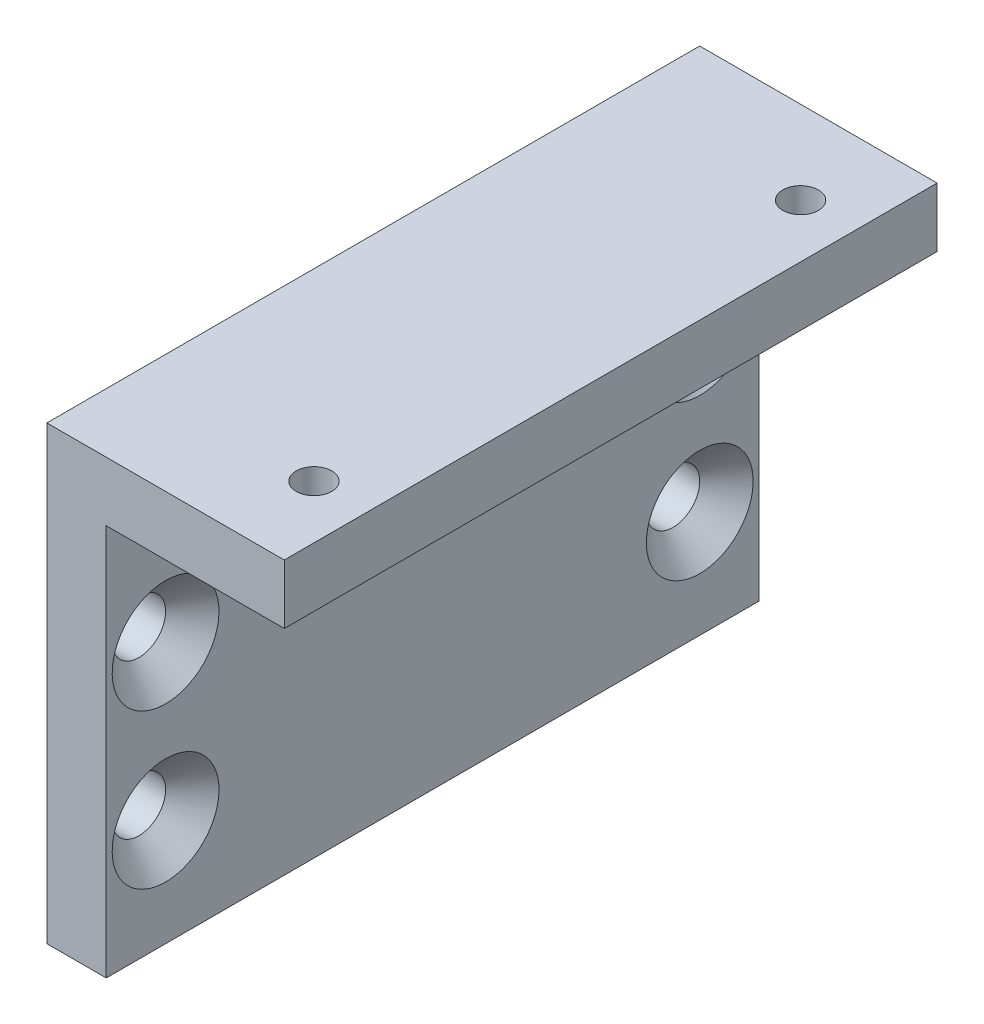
ISO-10303-21;
HEADER;
FILE_DESCRIPTION(('STEP AP214'),'2;1');
FILE_NAME('part.step','',(''),(''),'','','');
FILE_SCHEMA(('AUTOMOTIVE_DESIGN { 1 0 10303 214 1 1 1 1 }'));
ENDSEC;
DATA;
#1=APPLICATION_CONTEXT('core data for automotive mechanical design processes');
#2=APPLICATION_PROTOCOL_DEFINITION('international standard','automotive_design',2000,#1);
#3=PRODUCT_CONTEXT('',#1,'mechanical');
#4=PRODUCT('Part','Part','',(#3));
#5=PRODUCT_RELATED_PRODUCT_CATEGORY('part','',(#4));
#6=PRODUCT_DEFINITION_FORMATION('','',#4);
#7=PRODUCT_DEFINITION_CONTEXT('part definition',#1,'design');
#8=PRODUCT_DEFINITION('design','',#6,#7);
#9=PRODUCT_DEFINITION_SHAPE('','',#8);
#10=(LENGTH_UNIT() NAMED_UNIT(*) SI_UNIT(.MILLI.,.METRE.));
#11=(NAMED_UNIT(*) PLANE_ANGLE_UNIT() SI_UNIT($,.RADIAN.));
#12=(NAMED_UNIT(*) SI_UNIT($,.STERADIAN.) SOLID_ANGLE_UNIT());
#13=UNCERTAINTY_MEASURE_WITH_UNIT(LENGTH_MEASURE(1.E-05),#10,'distance_accuracy_value','');
#14=(GEOMETRIC_REPRESENTATION_CONTEXT(3) GLOBAL_UNCERTAINTY_ASSIGNED_CONTEXT((#13)) GLOBAL_UNIT_ASSIGNED_CONTEXT((#10,
#11,#12)) REPRESENTATION_CONTEXT('',''));
#15=CARTESIAN_POINT('',(0.,0.,0.));
#16=DIRECTION('',(0.,0.,1.));
#17=DIRECTION('',(1.,0.,0.));
#18=AXIS2_PLACEMENT_3D('',#15,#16,#17);
#19=CARTESIAN_POINT('',(4.99999000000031,-37.999924,27.499945));
#20=DIRECTION('',(1.,0.,0.));
#21=DIRECTION('',(0.,0.,-1.));
#22=AXIS2_PLACEMENT_3D('',#19,#20,#21);
#23=PLANE('',#22);
#24=CARTESIAN_POINT('',(4.99999000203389,-15.999968,22.499955));
#25=DIRECTION('',(1.,0.,0.));
#26=DIRECTION('',(0.,1.,0.));
#27=AXIS2_PLACEMENT_3D('',#24,#25,#26);
#28=CIRCLE('',#27,4.49999099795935);
#29=CARTESIAN_POINT('',(4.99999000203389,-11.4999770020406,22.499955));
#30=VERTEX_POINT('',#29);
#31=EDGE_CURVE('E76',#30,#30,#28,.F.);
#32=ORIENTED_EDGE('',*,*,#31,.T.);
#33=EDGE_LOOP('',(#32));
#34=FACE_BOUND('',#33,.T.);
#35=CARTESIAN_POINT('',(4.99999000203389,-28.9999419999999,22.499955));
#36=DIRECTION('',(1.,0.,0.));
#37=DIRECTION('',(0.,1.,0.));
#38=AXIS2_PLACEMENT_3D('',#35,#36,#37);
#39=CIRCLE('',#38,4.49999099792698);
#40=CARTESIAN_POINT('',(4.99999000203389,-24.4999510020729,22.499955));
#41=VERTEX_POINT('',#40);
#42=EDGE_CURVE('E115',#41,#41,#39,.F.);
#43=ORIENTED_EDGE('',*,*,#42,.T.);
#44=EDGE_LOOP('',(#43));
#45=FACE_BOUND('',#44,.T.);
#46=CARTESIAN_POINT('',(4.99999000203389,-15.999968,-22.499955));
#47=DIRECTION('',(1.,0.,0.));
#48=DIRECTION('',(0.,1.,0.));
#49=AXIS2_PLACEMENT_3D('',#46,#47,#48);
#50=CIRCLE('',#49,4.49999099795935);
#51=CARTESIAN_POINT('',(4.99999000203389,-11.4999770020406,-22.499955));
#52=VERTEX_POINT('',#51);
#53=EDGE_CURVE('E118',#52,#52,#50,.F.);
#54=ORIENTED_EDGE('',*,*,#53,.T.);
#55=EDGE_LOOP('',(#54));
#56=FACE_BOUND('',#55,.T.);
#57=CARTESIAN_POINT('',(4.99999000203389,-28.9999419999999,-22.499955));
#58=DIRECTION('',(1.,0.,0.));
#59=DIRECTION('',(0.,1.,0.));
#60=AXIS2_PLACEMENT_3D('',#57,#58,#59);
#61=CIRCLE('',#60,4.49999099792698);
#62=CARTESIAN_POINT('',(4.99999000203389,-24.4999510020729,-22.499955));
#63=VERTEX_POINT('',#62);
#64=EDGE_CURVE('E121',#63,#63,#61,.F.);
#65=ORIENTED_EDGE('',*,*,#64,.T.);
#66=EDGE_LOOP('',(#65));
#67=FACE_BOUND('',#66,.T.);
#68=DIRECTION('',(0.,1.,0.));
#69=VECTOR('',#68,1.);
#70=CARTESIAN_POINT('',(4.99999000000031,-14.3333046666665,27.499945));
#71=LINE('',#70,#69);
#72=CARTESIAN_POINT('',(4.99999000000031,-37.999924,27.499945));
#73=VERTEX_POINT('',#72);
#74=CARTESIAN_POINT('',(4.99999000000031,-4.99998999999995,27.499945));
#75=VERTEX_POINT('',#74);
#76=EDGE_CURVE('E213',#73,#75,#71,.T.);
#77=ORIENTED_EDGE('',*,*,#76,.F.);
#78=DIRECTION('',(0.,0.,-1.));
#79=VECTOR('',#78,1.);
#80=CARTESIAN_POINT('',(4.99999000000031,-37.999924,27.499945));
#81=LINE('',#80,#79);
#82=CARTESIAN_POINT('',(4.99999000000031,-37.999924,-27.499945));
#83=VERTEX_POINT('',#82);
#84=EDGE_CURVE('E215',#83,#73,#81,.F.);
#85=ORIENTED_EDGE('',*,*,#84,.F.);
#86=DIRECTION('',(0.,1.,0.));
#87=VECTOR('',#86,1.);
#88=CARTESIAN_POINT('',(4.99999000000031,-37.999924,-27.499945));
#89=LINE('',#88,#87);
#90=CARTESIAN_POINT('',(4.99999000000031,-4.99998999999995,-27.499945));
#91=VERTEX_POINT('',#90);
#92=EDGE_CURVE('E89',#83,#91,#89,.T.);
#93=ORIENTED_EDGE('',*,*,#92,.T.);
#94=DIRECTION('',(0.,0.,-1.));
#95=VECTOR('',#94,1.);
#96=CARTESIAN_POINT('',(4.99999000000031,-4.99998999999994,27.499945));
#97=LINE('',#96,#95);
#98=EDGE_CURVE('E65',#75,#91,#97,.T.);
#99=ORIENTED_EDGE('',*,*,#98,.F.);
#100=EDGE_LOOP('',(#77,#85,#93,#99));
#101=FACE_BOUND('',#100,.T.);
#102=ADVANCED_FACE('F15',(#34,#45,#56,#67,#101),#23,.T.);
#103=CARTESIAN_POINT('',(4.99999000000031,-4.99998999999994,27.499945));
#104=DIRECTION('',(0.,-1.,0.));
#105=DIRECTION('',(0.,0.,-1.));
#106=AXIS2_PLACEMENT_3D('',#103,#104,#105);
#107=PLANE('',#106);
#108=CARTESIAN_POINT('',(15.4999689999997,-4.99998999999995,20.499959));
#109=DIRECTION('',(0.,-1.,0.));
#110=DIRECTION('',(1.,0.,0.));
#111=AXIS2_PLACEMENT_3D('',#108,#109,#110);
#112=CIRCLE('',#111,1.499997);
#113=CARTESIAN_POINT('',(16.9999659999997,-4.99998999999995,20.499959));
#114=VERTEX_POINT('',#113);
#115=EDGE_CURVE('E123',#114,#114,#112,.F.);
#116=ORIENTED_EDGE('',*,*,#115,.T.);
#117=EDGE_LOOP('',(#116));
#118=FACE_BOUND('',#117,.T.);
#119=CARTESIAN_POINT('',(15.4999689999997,-4.99998999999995,-20.499959));
#120=DIRECTION('',(0.,-1.,0.));
#121=DIRECTION('',(1.,0.,0.));
#122=AXIS2_PLACEMENT_3D('',#119,#120,#121);
#123=CIRCLE('',#122,1.499997);
#124=CARTESIAN_POINT('',(16.9999659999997,-4.99998999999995,-20.499959));
#125=VERTEX_POINT('',#124);
#126=EDGE_CURVE('E18',#125,#125,#123,.F.);
#127=ORIENTED_EDGE('',*,*,#126,.T.);
#128=EDGE_LOOP('',(#127));
#129=FACE_BOUND('',#128,.T.);
#130=DIRECTION('',(1.,0.,0.));
#131=VECTOR('',#130,1.);
#132=CARTESIAN_POINT('',(8.33331666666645,-4.99998999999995,27.499945));
#133=LINE('',#132,#131);
#134=CARTESIAN_POINT('',(19.9999599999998,-4.99998999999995,27.499945));
#135=VERTEX_POINT('',#134);
#136=EDGE_CURVE('E217',#75,#135,#133,.T.);
#137=ORIENTED_EDGE('',*,*,#136,.F.);
#138=ORIENTED_EDGE('',*,*,#98,.T.);
#139=DIRECTION('',(1.,0.,0.));
#140=VECTOR('',#139,1.);
#141=CARTESIAN_POINT('',(4.99999000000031,-4.99998999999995,-27.499945));
#142=LINE('',#141,#140);
#143=CARTESIAN_POINT('',(19.9999599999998,-4.99998999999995,-27.499945));
#144=VERTEX_POINT('',#143);
#145=EDGE_CURVE('E68',#91,#144,#142,.T.);
#146=ORIENTED_EDGE('',*,*,#145,.T.);
#147=DIRECTION('',(0.,0.,-1.));
#148=VECTOR('',#147,1.);
#149=CARTESIAN_POINT('',(19.9999599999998,-4.99998999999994,27.499945));
#150=LINE('',#149,#148);
#151=EDGE_CURVE('E71',#135,#144,#150,.T.);
#152=ORIENTED_EDGE('',*,*,#151,.F.);
#153=EDGE_LOOP('',(#137,#138,#146,#152));
#154=FACE_BOUND('',#153,.T.);
#155=ADVANCED_FACE('F70',(#118,#129,#154),#107,.T.);
#156=CARTESIAN_POINT('',(19.9999599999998,-4.99998999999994,27.499945));
#157=DIRECTION('',(1.,0.,0.));
#158=DIRECTION('',(0.,0.,-1.));
#159=AXIS2_PLACEMENT_3D('',#156,#157,#158);
#160=PLANE('',#159);
#161=DIRECTION('',(0.,1.,0.));
#162=VECTOR('',#161,1.);
#163=CARTESIAN_POINT('',(19.9999599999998,-14.3333046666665,27.499945));
#164=LINE('',#163,#162);
#165=CARTESIAN_POINT('',(19.9999599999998,0.,27.499945));
#166=VERTEX_POINT('',#165);
#167=EDGE_CURVE('E82',#135,#166,#164,.T.);
#168=ORIENTED_EDGE('',*,*,#167,.F.);
#169=ORIENTED_EDGE('',*,*,#151,.T.);
#170=DIRECTION('',(0.,1.,0.));
#171=VECTOR('',#170,1.);
#172=CARTESIAN_POINT('',(19.9999599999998,-37.999924,-27.499945));
#173=LINE('',#172,#171);
#174=CARTESIAN_POINT('',(19.9999599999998,0.,-27.499945));
#175=VERTEX_POINT('',#174);
#176=EDGE_CURVE('E75',#144,#175,#173,.T.);
#177=ORIENTED_EDGE('',*,*,#176,.T.);
#178=DIRECTION('',(0.,0.,1.));
#179=VECTOR('',#178,1.);
#180=CARTESIAN_POINT('',(19.9999599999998,0.,27.499945));
#181=LINE('',#180,#179);
#182=EDGE_CURVE('E112',#166,#175,#181,.F.);
#183=ORIENTED_EDGE('',*,*,#182,.F.);
#184=EDGE_LOOP('',(#168,#169,#177,#183));
#185=FACE_BOUND('',#184,.T.);
#186=ADVANCED_FACE('F79',(#185),#160,.T.);
#187=CARTESIAN_POINT('',(15.4999689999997,0.,-20.499959));
#188=DIRECTION('',(0.,-1.,0.));
#189=DIRECTION('',(1.,0.,0.));
#190=AXIS2_PLACEMENT_3D('',#187,#188,#189);
#191=CYLINDRICAL_SURFACE('',#190,1.499997);
#192=CARTESIAN_POINT('',(15.4999689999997,0.,-20.499959));
#193=DIRECTION('',(0.,-1.,0.));
#194=DIRECTION('',(1.,0.,0.));
#195=AXIS2_PLACEMENT_3D('',#192,#193,#194);
#196=CIRCLE('',#195,1.499997);
#197=CARTESIAN_POINT('',(16.9999659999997,0.,-20.499959));
#198=VERTEX_POINT('',#197);
#199=EDGE_CURVE('E109',#198,#198,#196,.T.);
#200=ORIENTED_EDGE('',*,*,#199,.F.);
#201=EDGE_LOOP('',(#200));
#202=FACE_BOUND('',#201,.T.);
#203=ORIENTED_EDGE('',*,*,#126,.F.);
#204=EDGE_LOOP('',(#203));
#205=FACE_BOUND('',#204,.T.);
#206=ADVANCED_FACE('F131',(#202,#205),#191,.F.);
#207=CARTESIAN_POINT('',(15.4999689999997,0.,20.499959));
#208=DIRECTION('',(0.,-1.,0.));
#209=DIRECTION('',(1.,0.,0.));
#210=AXIS2_PLACEMENT_3D('',#207,#208,#209);
#211=CYLINDRICAL_SURFACE('',#210,1.499997);
#212=CARTESIAN_POINT('',(15.4999689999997,0.,20.499959));
#213=DIRECTION('',(0.,-1.,0.));
#214=DIRECTION('',(1.,0.,0.));
#215=AXIS2_PLACEMENT_3D('',#212,#213,#214);
#216=CIRCLE('',#215,1.499997);
#217=CARTESIAN_POINT('',(16.9999659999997,0.,20.499959));
#218=VERTEX_POINT('',#217);
#219=EDGE_CURVE('E105',#218,#218,#216,.T.);
#220=ORIENTED_EDGE('',*,*,#219,.F.);
#221=EDGE_LOOP('',(#220));
#222=FACE_BOUND('',#221,.T.);
#223=ORIENTED_EDGE('',*,*,#115,.F.);
#224=EDGE_LOOP('',(#223));
#225=FACE_BOUND('',#224,.T.);
#226=ADVANCED_FACE('F133',(#222,#225),#211,.F.);
#227=CARTESIAN_POINT('',(4.99999000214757,-28.9999419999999,-22.499955));
#228=DIRECTION('',(1.,0.,0.));
#229=DIRECTION('',(0.,1.,0.));
#230=AXIS2_PLACEMENT_3D('',#227,#228,#229);
#231=CONICAL_SURFACE('',#230,4.49999099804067,0.785398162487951);
#232=CARTESIAN_POINT('',(2.74999450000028,-28.9999419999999,-22.499955));
#233=DIRECTION('',(1.,0.,0.));
#234=DIRECTION('',(0.,1.,0.));
#235=AXIS2_PLACEMENT_3D('',#232,#233,#234);
#236=CIRCLE('',#235,2.2499955);
#237=CARTESIAN_POINT('',(2.74999450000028,-26.7499464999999,-22.499955));
#238=VERTEX_POINT('',#237);
#239=EDGE_CURVE('E108',#238,#238,#236,.F.);
#240=ORIENTED_EDGE('',*,*,#239,.T.);
#241=EDGE_LOOP('',(#240));
#242=FACE_BOUND('',#241,.T.);
#243=ORIENTED_EDGE('',*,*,#64,.F.);
#244=EDGE_LOOP('',(#243));
#245=FACE_BOUND('',#244,.T.);
#246=ADVANCED_FACE('F142',(#242,#245),#231,.F.);
#247=CARTESIAN_POINT('',(4.99999000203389,-15.999968,-22.499955));
#248=DIRECTION('',(1.,0.,0.));
#249=DIRECTION('',(0.,1.,0.));
#250=AXIS2_PLACEMENT_3D('',#247,#248,#249);
#251=CONICAL_SURFACE('',#250,4.49999099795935,0.785398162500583);
#252=CARTESIAN_POINT('',(2.74999450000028,-15.999968,-22.499955));
#253=DIRECTION('',(1.,0.,0.));
#254=DIRECTION('',(0.,1.,0.));
#255=AXIS2_PLACEMENT_3D('',#252,#253,#254);
#256=CIRCLE('',#255,2.2499955);
#257=CARTESIAN_POINT('',(2.74999450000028,-13.7499725,-22.499955));
#258=VERTEX_POINT('',#257);
#259=EDGE_CURVE('E247',#258,#258,#256,.F.);
#260=ORIENTED_EDGE('',*,*,#259,.T.);
#261=EDGE_LOOP('',(#260));
#262=FACE_BOUND('',#261,.T.);
#263=ORIENTED_EDGE('',*,*,#53,.F.);
#264=EDGE_LOOP('',(#263));
#265=FACE_BOUND('',#264,.T.);
#266=ADVANCED_FACE('F192',(#262,#265),#251,.F.);
#267=CARTESIAN_POINT('',(4.99999000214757,-28.9999419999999,22.499955));
#268=DIRECTION('',(1.,0.,0.));
#269=DIRECTION('',(0.,1.,0.));
#270=AXIS2_PLACEMENT_3D('',#267,#268,#269);
#271=CONICAL_SURFACE('',#270,4.49999099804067,0.785398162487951);
#272=CARTESIAN_POINT('',(2.74999450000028,-28.9999419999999,22.499955));
#273=DIRECTION('',(1.,0.,0.));
#274=DIRECTION('',(0.,1.,0.));
#275=AXIS2_PLACEMENT_3D('',#272,#273,#274);
#276=CIRCLE('',#275,2.2499955);
#277=CARTESIAN_POINT('',(2.74999450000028,-26.7499464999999,22.499955));
#278=VERTEX_POINT('',#277);
#279=EDGE_CURVE('E242',#278,#278,#276,.F.);
#280=ORIENTED_EDGE('',*,*,#279,.T.);
#281=EDGE_LOOP('',(#280));
#282=FACE_BOUND('',#281,.T.);
#283=ORIENTED_EDGE('',*,*,#42,.F.);
#284=EDGE_LOOP('',(#283));
#285=FACE_BOUND('',#284,.T.);
#286=ADVANCED_FACE('F188',(#282,#285),#271,.F.);
#287=CARTESIAN_POINT('',(4.99999000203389,-15.999968,22.499955));
#288=DIRECTION('',(1.,0.,0.));
#289=DIRECTION('',(0.,1.,0.));
#290=AXIS2_PLACEMENT_3D('',#287,#288,#289);
#291=CONICAL_SURFACE('',#290,4.49999099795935,0.785398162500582);
#292=CARTESIAN_POINT('',(2.74999450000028,-15.999968,22.499955));
#293=DIRECTION('',(1.,0.,0.));
#294=DIRECTION('',(0.,1.,0.));
#295=AXIS2_PLACEMENT_3D('',#292,#293,#294);
#296=CIRCLE('',#295,2.2499955);
#297=CARTESIAN_POINT('',(2.74999450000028,-13.7499725,22.499955));
#298=VERTEX_POINT('',#297);
#299=EDGE_CURVE('E232',#298,#298,#296,.F.);
#300=ORIENTED_EDGE('',*,*,#299,.T.);
#301=EDGE_LOOP('',(#300));
#302=FACE_BOUND('',#301,.T.);
#303=ORIENTED_EDGE('',*,*,#31,.F.);
#304=EDGE_LOOP('',(#303));
#305=FACE_BOUND('',#304,.T.);
#306=ADVANCED_FACE('F185',(#302,#305),#291,.F.);
#307=CARTESIAN_POINT('',(4.99999000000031,-37.999924,-27.499945));
#308=DIRECTION('',(0.,0.,1.));
#309=DIRECTION('',(1.,0.,0.));
#310=AXIS2_PLACEMENT_3D('',#307,#308,#309);
#311=PLANE('',#310);
#312=DIRECTION('',(1.,0.,0.));
#313=VECTOR('',#312,1.);
#314=CARTESIAN_POINT('',(0.,-37.999924,-27.499945));
#315=LINE('',#314,#313);
#316=CARTESIAN_POINT('',(0.,-37.999924,-27.499945));
#317=VERTEX_POINT('',#316);
#318=EDGE_CURVE('E91',#317,#83,#315,.T.);
#319=ORIENTED_EDGE('',*,*,#318,.F.);
#320=DIRECTION('',(0.,1.,0.));
#321=VECTOR('',#320,1.);
#322=CARTESIAN_POINT('',(0.,0.,-27.499945));
#323=LINE('',#322,#321);
#324=CARTESIAN_POINT('',(0.,0.,-27.499945));
#325=VERTEX_POINT('',#324);
#326=EDGE_CURVE('E229',#325,#317,#323,.F.);
#327=ORIENTED_EDGE('',*,*,#326,.F.);
#328=DIRECTION('',(1.,0.,0.));
#329=VECTOR('',#328,1.);
#330=CARTESIAN_POINT('',(19.9999599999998,0.,-27.499945));
#331=LINE('',#330,#329);
#332=EDGE_CURVE('E87',#175,#325,#331,.F.);
#333=ORIENTED_EDGE('',*,*,#332,.F.);
#334=ORIENTED_EDGE('',*,*,#176,.F.);
#335=ORIENTED_EDGE('',*,*,#145,.F.);
#336=ORIENTED_EDGE('',*,*,#92,.F.);
#337=EDGE_LOOP('',(#319,#327,#333,#334,#335,#336));
#338=FACE_BOUND('',#337,.T.);
#339=ADVANCED_FACE('F85',(#338),#311,.F.);
#340=CARTESIAN_POINT('',(0.,-37.999924,27.499945));
#341=DIRECTION('',(0.,-1.,0.));
#342=DIRECTION('',(0.,0.,-1.));
#343=AXIS2_PLACEMENT_3D('',#340,#341,#342);
#344=PLANE('',#343);
#345=DIRECTION('',(1.,0.,0.));
#346=VECTOR('',#345,1.);
#347=CARTESIAN_POINT('',(8.33331666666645,-37.999924,27.499945));
#348=LINE('',#347,#346);
#349=CARTESIAN_POINT('',(0.,-37.999924,27.499945));
#350=VERTEX_POINT('',#349);
#351=EDGE_CURVE('E218',#350,#73,#348,.T.);
#352=ORIENTED_EDGE('',*,*,#351,.F.);
#353=DIRECTION('',(0.,0.,1.));
#354=VECTOR('',#353,1.);
#355=CARTESIAN_POINT('',(0.,-37.999924,27.499945));
#356=LINE('',#355,#354);
#357=EDGE_CURVE('E227',#317,#350,#356,.T.);
#358=ORIENTED_EDGE('',*,*,#357,.F.);
#359=ORIENTED_EDGE('',*,*,#318,.T.);
#360=ORIENTED_EDGE('',*,*,#84,.T.);
#361=EDGE_LOOP('',(#352,#358,#359,#360));
#362=FACE_BOUND('',#361,.T.);
#363=ADVANCED_FACE('F179',(#362),#344,.T.);
#364=CARTESIAN_POINT('',(8.33331666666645,-14.3333046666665,27.499945));
#365=DIRECTION('',(0.,0.,1.));
#366=DIRECTION('',(1.,0.,0.));
#367=AXIS2_PLACEMENT_3D('',#364,#365,#366);
#368=PLANE('',#367);
#369=DIRECTION('',(1.,0.,0.));
#370=VECTOR('',#369,1.);
#371=CARTESIAN_POINT('',(19.9999599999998,0.,27.499945));
#372=LINE('',#371,#370);
#373=CARTESIAN_POINT('',(0.,0.,27.499945));
#374=VERTEX_POINT('',#373);
#375=EDGE_CURVE('E33',#374,#166,#372,.T.);
#376=ORIENTED_EDGE('',*,*,#375,.F.);
#377=DIRECTION('',(0.,1.,0.));
#378=VECTOR('',#377,1.);
#379=CARTESIAN_POINT('',(0.,0.,27.499945));
#380=LINE('',#379,#378);
#381=EDGE_CURVE('E221',#350,#374,#380,.T.);
#382=ORIENTED_EDGE('',*,*,#381,.F.);
#383=ORIENTED_EDGE('',*,*,#351,.T.);
#384=ORIENTED_EDGE('',*,*,#76,.T.);
#385=ORIENTED_EDGE('',*,*,#136,.T.);
#386=ORIENTED_EDGE('',*,*,#167,.T.);
#387=EDGE_LOOP('',(#376,#382,#383,#384,#385,#386));
#388=FACE_BOUND('',#387,.T.);
#389=ADVANCED_FACE('F175',(#388),#368,.T.);
#390=CARTESIAN_POINT('',(19.9999599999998,0.,27.499945));
#391=DIRECTION('',(0.,1.,0.));
#392=DIRECTION('',(0.,0.,1.));
#393=AXIS2_PLACEMENT_3D('',#390,#391,#392);
#394=PLANE('',#393);
#395=ORIENTED_EDGE('',*,*,#219,.T.);
#396=EDGE_LOOP('',(#395));
#397=FACE_BOUND('',#396,.T.);
#398=ORIENTED_EDGE('',*,*,#199,.T.);
#399=EDGE_LOOP('',(#398));
#400=FACE_BOUND('',#399,.T.);
#401=ORIENTED_EDGE('',*,*,#375,.T.);
#402=ORIENTED_EDGE('',*,*,#182,.T.);
#403=ORIENTED_EDGE('',*,*,#332,.T.);
#404=DIRECTION('',(0.,0.,1.));
#405=VECTOR('',#404,1.);
#406=CARTESIAN_POINT('',(0.,0.,27.499945));
#407=LINE('',#406,#405);
#408=EDGE_CURVE('E104',#374,#325,#407,.F.);
#409=ORIENTED_EDGE('',*,*,#408,.F.);
#410=EDGE_LOOP('',(#401,#402,#403,#409));
#411=FACE_BOUND('',#410,.T.);
#412=ADVANCED_FACE('F171',(#397,#400,#411),#394,.T.);
#413=CARTESIAN_POINT('',(0.,-28.9999419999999,-22.499955));
#414=DIRECTION('',(1.,0.,0.));
#415=DIRECTION('',(0.,1.,0.));
#416=AXIS2_PLACEMENT_3D('',#413,#414,#415);
#417=CYLINDRICAL_SURFACE('',#416,2.2499955);
#418=ORIENTED_EDGE('',*,*,#239,.F.);
#419=EDGE_LOOP('',(#418));
#420=FACE_BOUND('',#419,.T.);
#421=CARTESIAN_POINT('',(0.,-28.9999419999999,-22.499955));
#422=DIRECTION('',(1.,0.,0.));
#423=DIRECTION('',(0.,1.,0.));
#424=AXIS2_PLACEMENT_3D('',#421,#422,#423);
#425=CIRCLE('',#424,2.2499955);
#426=CARTESIAN_POINT('',(0.,-26.7499464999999,-22.499955));
#427=VERTEX_POINT('',#426);
#428=EDGE_CURVE('E101',#427,#427,#425,.T.);
#429=ORIENTED_EDGE('',*,*,#428,.F.);
#430=EDGE_LOOP('',(#429));
#431=FACE_BOUND('',#430,.T.);
#432=ADVANCED_FACE('F167',(#420,#431),#417,.F.);
#433=CARTESIAN_POINT('',(0.,-15.999968,-22.499955));
#434=DIRECTION('',(1.,0.,0.));
#435=DIRECTION('',(0.,1.,0.));
#436=AXIS2_PLACEMENT_3D('',#433,#434,#435);
#437=CYLINDRICAL_SURFACE('',#436,2.2499955);
#438=ORIENTED_EDGE('',*,*,#259,.F.);
#439=EDGE_LOOP('',(#438));
#440=FACE_BOUND('',#439,.T.);
#441=CARTESIAN_POINT('',(0.,-15.999968,-22.499955));
#442=DIRECTION('',(1.,0.,0.));
#443=DIRECTION('',(0.,1.,0.));
#444=AXIS2_PLACEMENT_3D('',#441,#442,#443);
#445=CIRCLE('',#444,2.2499955);
#446=CARTESIAN_POINT('',(0.,-13.7499725,-22.499955));
#447=VERTEX_POINT('',#446);
#448=EDGE_CURVE('E98',#447,#447,#445,.T.);
#449=ORIENTED_EDGE('',*,*,#448,.F.);
#450=EDGE_LOOP('',(#449));
#451=FACE_BOUND('',#450,.T.);
#452=ADVANCED_FACE('F163',(#440,#451),#437,.F.);
#453=CARTESIAN_POINT('',(0.,-28.9999419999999,22.499955));
#454=DIRECTION('',(1.,0.,0.));
#455=DIRECTION('',(0.,1.,0.));
#456=AXIS2_PLACEMENT_3D('',#453,#454,#455);
#457=CYLINDRICAL_SURFACE('',#456,2.2499955);
#458=ORIENTED_EDGE('',*,*,#279,.F.);
#459=EDGE_LOOP('',(#458));
#460=FACE_BOUND('',#459,.T.);
#461=CARTESIAN_POINT('',(0.,-28.9999419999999,22.499955));
#462=DIRECTION('',(1.,0.,0.));
#463=DIRECTION('',(0.,1.,0.));
#464=AXIS2_PLACEMENT_3D('',#461,#462,#463);
#465=CIRCLE('',#464,2.2499955);
#466=CARTESIAN_POINT('',(0.,-26.7499464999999,22.499955));
#467=VERTEX_POINT('',#466);
#468=EDGE_CURVE('E24',#467,#467,#465,.T.);
#469=ORIENTED_EDGE('',*,*,#468,.F.);
#470=EDGE_LOOP('',(#469));
#471=FACE_BOUND('',#470,.T.);
#472=ADVANCED_FACE('F156',(#460,#471),#457,.F.);
#473=CARTESIAN_POINT('',(0.,-15.999968,22.499955));
#474=DIRECTION('',(1.,0.,0.));
#475=DIRECTION('',(0.,1.,0.));
#476=AXIS2_PLACEMENT_3D('',#473,#474,#475);
#477=CYLINDRICAL_SURFACE('',#476,2.2499955);
#478=ORIENTED_EDGE('',*,*,#299,.F.);
#479=EDGE_LOOP('',(#478));
#480=FACE_BOUND('',#479,.T.);
#481=CARTESIAN_POINT('',(0.,-15.999968,22.499955));
#482=DIRECTION('',(1.,0.,0.));
#483=DIRECTION('',(0.,1.,0.));
#484=AXIS2_PLACEMENT_3D('',#481,#482,#483);
#485=CIRCLE('',#484,2.2499955);
#486=CARTESIAN_POINT('',(0.,-13.7499725,22.499955));
#487=VERTEX_POINT('',#486);
#488=EDGE_CURVE('E10',#487,#487,#485,.T.);
#489=ORIENTED_EDGE('',*,*,#488,.F.);
#490=EDGE_LOOP('',(#489));
#491=FACE_BOUND('',#490,.T.);
#492=ADVANCED_FACE('F149',(#480,#491),#477,.F.);
#493=CARTESIAN_POINT('',(0.,0.,27.499945));
#494=DIRECTION('',(-1.,0.,0.));
#495=DIRECTION('',(0.,0.,1.));
#496=AXIS2_PLACEMENT_3D('',#493,#494,#495);
#497=PLANE('',#496);
#498=ORIENTED_EDGE('',*,*,#488,.T.);
#499=EDGE_LOOP('',(#498));
#500=FACE_BOUND('',#499,.T.);
#501=ORIENTED_EDGE('',*,*,#468,.T.);
#502=EDGE_LOOP('',(#501));
#503=FACE_BOUND('',#502,.T.);
#504=ORIENTED_EDGE('',*,*,#448,.T.);
#505=EDGE_LOOP('',(#504));
#506=FACE_BOUND('',#505,.T.);
#507=ORIENTED_EDGE('',*,*,#428,.T.);
#508=EDGE_LOOP('',(#507));
#509=FACE_BOUND('',#508,.T.);
#510=ORIENTED_EDGE('',*,*,#381,.T.);
#511=ORIENTED_EDGE('',*,*,#408,.T.);
#512=ORIENTED_EDGE('',*,*,#326,.T.);
#513=ORIENTED_EDGE('',*,*,#357,.T.);
#514=EDGE_LOOP('',(#510,#511,#512,#513));
#515=FACE_BOUND('',#514,.T.);
#516=ADVANCED_FACE('F147',(#500,#503,#506,#509,#515),#497,.T.);
#517=CLOSED_SHELL('',(#102,#155,#186,#206,#226,#246,#266,#286,#306,#339,#363,#389,#412,#432,
#452,#472,#492,#516));
#518=MANIFOLD_SOLID_BREP('B1',#517);
#519=ADVANCED_BREP_SHAPE_REPRESENTATION('',(#18,#518),#14);
#520=SHAPE_DEFINITION_REPRESENTATION(#9,#519);
ENDSEC;
END-ISO-10303-21;
